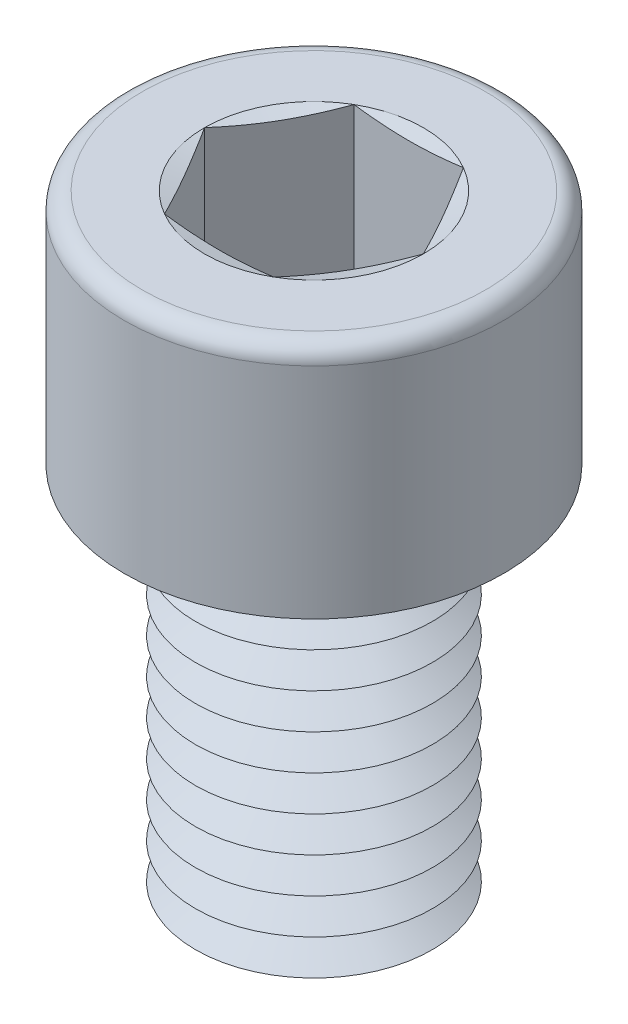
from build123d import *

# Parameters (mm, degrees)
SKETCH1_R       = 5
EXTRUDE1_DEPTH  = 16
SKETCH2_R       = 8
EXTRUDE2_DEPTH  = 10
EXTRUDE3_DEPTH  = 8
FILLET1_R       = 0.75
LPATTERN1_COUNT = 11
LPATTERN1_PITCH = 1.5


with BuildPart() as part:
    # Sketch1 → Extrude1 (new body)
    with BuildSketch(Plane(origin=(0, 0, 0), x_dir=(1, 0, 0), z_dir=(0, 1, 0))):
        with Locations(Location((0, 0, 0), (0, 0, 270))):
            Circle(SKETCH1_R)
    extrude(amount=EXTRUDE1_DEPTH)

    # Sketch2 → Extrude2 (add)
    with BuildSketch(Plane(origin=(0, 16, 0), x_dir=(1, 0, 0), z_dir=(0, 1, 0))):
        with Locations(Location((0, 0, 0), (0, 0, 270))):
            Circle(SKETCH2_R)
    extrude(amount=EXTRUDE2_DEPTH)

    # Sketch3 → Extrude3 (cut)
    with BuildSketch(Plane(origin=(0, 26, 0), x_dir=(1, 0, 0), z_dir=(0, 1, 0))):
        Polygon((2.309401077, 4), (-2.309401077, 4), (-4.618802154, 0), (-2.309401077, -4), (2.309401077, -4), (4.618802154, 0), align=None)
    extrude(amount=-EXTRUDE3_DEPTH, mode=Mode.SUBTRACT)

    # Fillet1
    fillet1_edges = [part.edges().sort_by_distance(p)[0] for p in [
        (0, 26, -8),
    ]]
    fillet(fillet1_edges, radius=FILLET1_R)

    # Sketch4 → Cut-Revolve1 (revolve, cut)
    with BuildSketch(Plane(origin=(0, 0, 0), x_dir=(0, 0, -1), z_dir=(1, 0, 0))):
        Polygon((-4, 18), (0, 18), (0, 15.690598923), align=None)
    revolve(axis=Axis((0, 18, 0), (0, -1, 0)), mode=Mode.SUBTRACT)

    # Sketch5 → Cut-Revolve2 (revolve, cut)
    with BuildSketch(Plane.XY, mode=Mode.PRIVATE) as cut_revolve2_sk:
        Polygon((-5, 0.75), (-5, -0.75), (-3.700961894, 0), align=None)
    cut_revolve2 = revolve(cut_revolve2_sk.sketch.rotate(Axis((0, 16, 0), (0, -1, 0)), 270), axis=Axis((0, 16, 0), (0, -1, 0)), mode=Mode.SUBTRACT)

    # LPattern1: Cut-Revolve2 ×11
    with Locations(*[(0, i * LPATTERN1_PITCH, 0) for i in range(1, LPATTERN1_COUNT)]):
        add(cut_revolve2, mode=Mode.SUBTRACT)

    # Extrude4 cone 1 section (on through the dimple's axis) → Extrude4 (revolve, cut)
    with BuildSketch(Plane(origin=(0, 26, 0), x_dir=(0, 0, 1), z_dir=(1, 0, 0))):
        Polygon((0, 0), (4.618802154, 0), (0, 1.237604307), align=None)
    revolve(axis=Axis((0, 26, 0), (0, -1, 0)), mode=Mode.SUBTRACT)


solid = part.part
